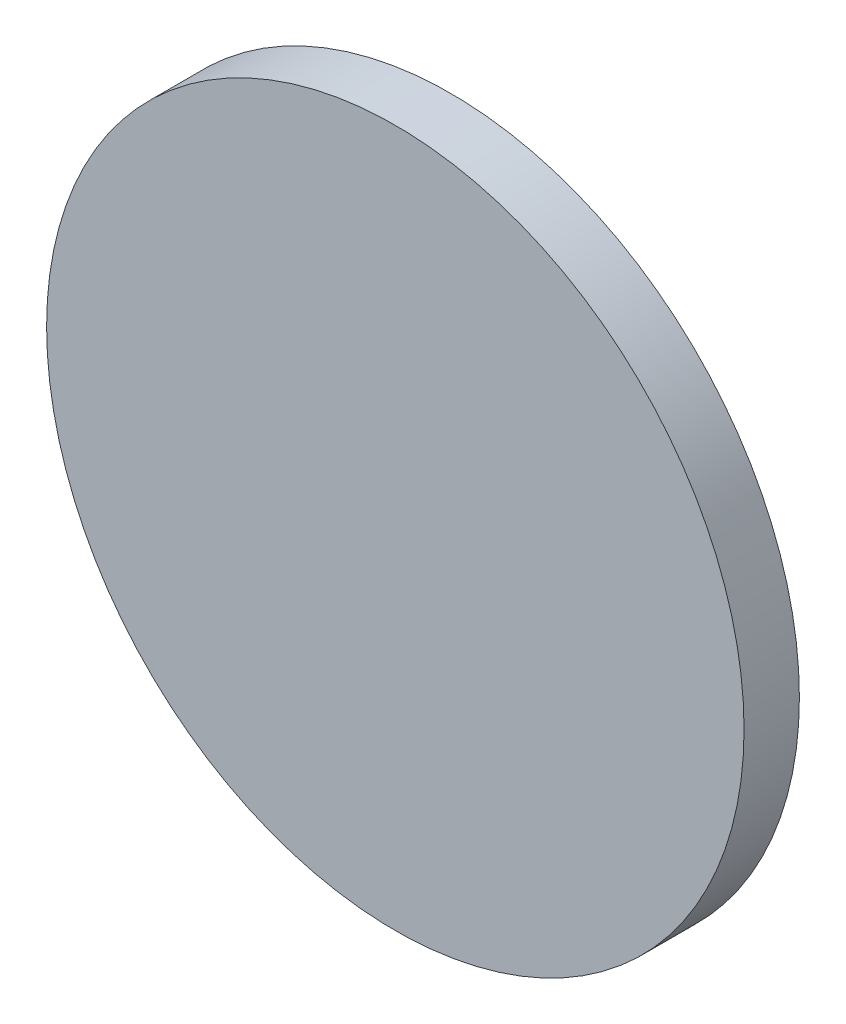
ISO-10303-21;
HEADER;
FILE_DESCRIPTION(('STEP AP214'),'2;1');
FILE_NAME('part.step','',(''),(''),'','','');
FILE_SCHEMA(('AUTOMOTIVE_DESIGN { 1 0 10303 214 1 1 1 1 }'));
ENDSEC;
DATA;
#1=APPLICATION_CONTEXT('core data for automotive mechanical design processes');
#2=APPLICATION_PROTOCOL_DEFINITION('international standard','automotive_design',2000,#1);
#3=PRODUCT_CONTEXT('',#1,'mechanical');
#4=PRODUCT('Part','Part','',(#3));
#5=PRODUCT_RELATED_PRODUCT_CATEGORY('part','',(#4));
#6=PRODUCT_DEFINITION_FORMATION('','',#4);
#7=PRODUCT_DEFINITION_CONTEXT('part definition',#1,'design');
#8=PRODUCT_DEFINITION('design','',#6,#7);
#9=PRODUCT_DEFINITION_SHAPE('','',#8);
#10=(LENGTH_UNIT() NAMED_UNIT(*) SI_UNIT(.MILLI.,.METRE.));
#11=(NAMED_UNIT(*) PLANE_ANGLE_UNIT() SI_UNIT($,.RADIAN.));
#12=(NAMED_UNIT(*) SI_UNIT($,.STERADIAN.) SOLID_ANGLE_UNIT());
#13=UNCERTAINTY_MEASURE_WITH_UNIT(LENGTH_MEASURE(1.E-05),#10,'distance_accuracy_value','');
#14=(GEOMETRIC_REPRESENTATION_CONTEXT(3) GLOBAL_UNCERTAINTY_ASSIGNED_CONTEXT((#13)) GLOBAL_UNIT_ASSIGNED_CONTEXT((#10,
#11,#12)) REPRESENTATION_CONTEXT('',''));
#15=CARTESIAN_POINT('',(0.,0.,0.));
#16=DIRECTION('',(0.,0.,1.));
#17=DIRECTION('',(1.,0.,0.));
#18=AXIS2_PLACEMENT_3D('',#15,#16,#17);
#19=CARTESIAN_POINT('',(0.,0.,3.0226));
#20=DIRECTION('',(0.,0.,-1.));
#21=DIRECTION('',(-1.,0.,0.));
#22=AXIS2_PLACEMENT_3D('',#19,#20,#21);
#23=CYLINDRICAL_SURFACE('',#22,19.05);
#24=CARTESIAN_POINT('',(0.,0.,3.0226));
#25=DIRECTION('',(0.,0.,1.));
#26=DIRECTION('',(1.,0.,0.));
#27=AXIS2_PLACEMENT_3D('',#24,#25,#26);
#28=CIRCLE('',#27,19.05);
#29=CARTESIAN_POINT('',(19.05,0.,3.0226));
#30=VERTEX_POINT('',#29);
#31=EDGE_CURVE('E10',#30,#30,#28,.T.);
#32=ORIENTED_EDGE('',*,*,#31,.F.);
#33=EDGE_LOOP('',(#32));
#34=FACE_BOUND('',#33,.T.);
#35=CARTESIAN_POINT('',(0.,0.,0.));
#36=DIRECTION('',(0.,0.,1.));
#37=DIRECTION('',(1.,0.,0.));
#38=AXIS2_PLACEMENT_3D('',#35,#36,#37);
#39=CIRCLE('',#38,19.05);
#40=CARTESIAN_POINT('',(19.05,0.,0.));
#41=VERTEX_POINT('',#40);
#42=EDGE_CURVE('E36',#41,#41,#39,.T.);
#43=ORIENTED_EDGE('',*,*,#42,.T.);
#44=EDGE_LOOP('',(#43));
#45=FACE_BOUND('',#44,.T.);
#46=ADVANCED_FACE('F33',(#34,#45),#23,.T.);
#47=CARTESIAN_POINT('',(0.,0.,3.0226));
#48=DIRECTION('',(0.,0.,1.));
#49=DIRECTION('',(1.,0.,0.));
#50=AXIS2_PLACEMENT_3D('',#47,#48,#49);
#51=PLANE('',#50);
#52=ORIENTED_EDGE('',*,*,#31,.T.);
#53=EDGE_LOOP('',(#52));
#54=FACE_BOUND('',#53,.T.);
#55=ADVANCED_FACE('F48',(#54),#51,.T.);
#56=CARTESIAN_POINT('',(0.,0.,0.));
#57=DIRECTION('',(0.,0.,1.));
#58=DIRECTION('',(1.,0.,0.));
#59=AXIS2_PLACEMENT_3D('',#56,#57,#58);
#60=PLANE('',#59);
#61=ORIENTED_EDGE('',*,*,#42,.F.);
#62=EDGE_LOOP('',(#61));
#63=FACE_BOUND('',#62,.T.);
#64=ADVANCED_FACE('F46',(#63),#60,.F.);
#65=CLOSED_SHELL('',(#46,#55,#64));
#66=MANIFOLD_SOLID_BREP('B2',#65);
#67=ADVANCED_BREP_SHAPE_REPRESENTATION('',(#18,#66),#14);
#68=SHAPE_DEFINITION_REPRESENTATION(#9,#67);
ENDSEC;
END-ISO-10303-21;
